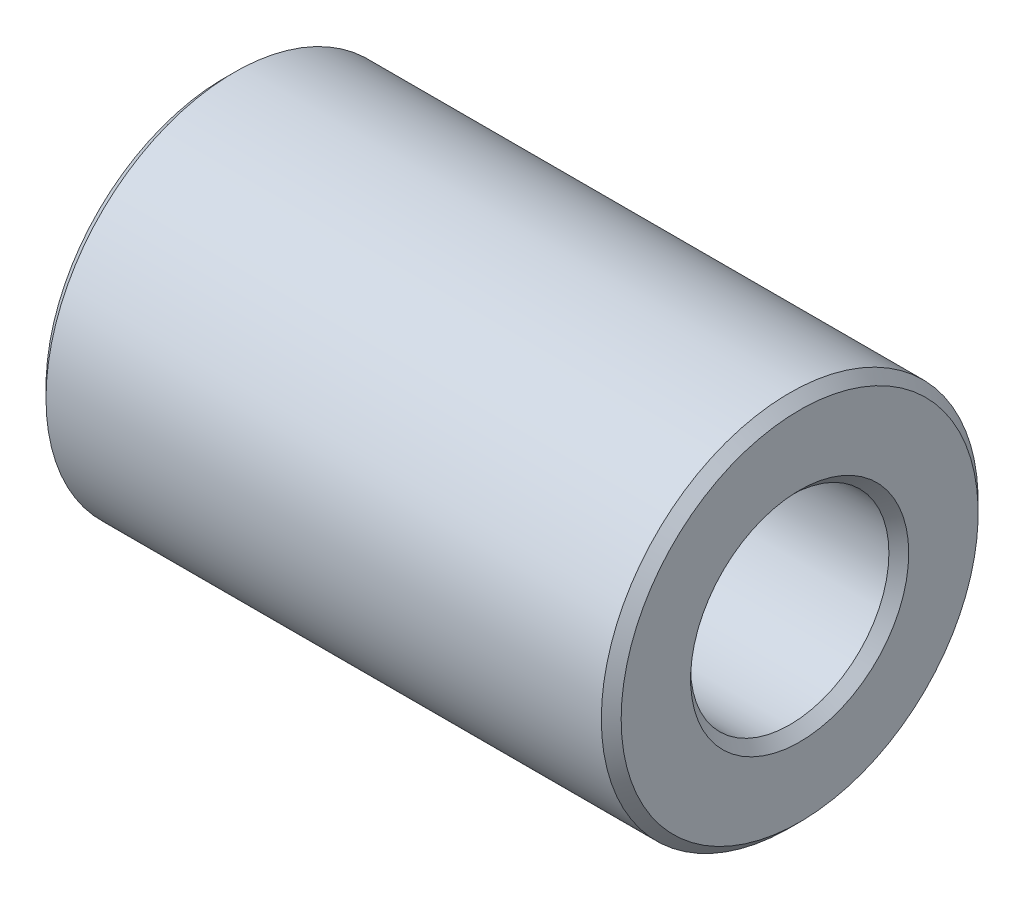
ISO-10303-21;
HEADER;
FILE_DESCRIPTION(('STEP AP214'),'2;1');
FILE_NAME('part.step','',(''),(''),'','','');
FILE_SCHEMA(('AUTOMOTIVE_DESIGN { 1 0 10303 214 1 1 1 1 }'));
ENDSEC;
DATA;
#1=APPLICATION_CONTEXT('core data for automotive mechanical design processes');
#2=APPLICATION_PROTOCOL_DEFINITION('international standard','automotive_design',2000,#1);
#3=PRODUCT_CONTEXT('',#1,'mechanical');
#4=PRODUCT('Part','Part','',(#3));
#5=PRODUCT_RELATED_PRODUCT_CATEGORY('part','',(#4));
#6=PRODUCT_DEFINITION_FORMATION('','',#4);
#7=PRODUCT_DEFINITION_CONTEXT('part definition',#1,'design');
#8=PRODUCT_DEFINITION('design','',#6,#7);
#9=PRODUCT_DEFINITION_SHAPE('','',#8);
#10=(LENGTH_UNIT() NAMED_UNIT(*) SI_UNIT(.MILLI.,.METRE.));
#11=(NAMED_UNIT(*) PLANE_ANGLE_UNIT() SI_UNIT($,.RADIAN.));
#12=(NAMED_UNIT(*) SI_UNIT($,.STERADIAN.) SOLID_ANGLE_UNIT());
#13=UNCERTAINTY_MEASURE_WITH_UNIT(LENGTH_MEASURE(1.E-05),#10,'distance_accuracy_value','');
#14=(GEOMETRIC_REPRESENTATION_CONTEXT(3) GLOBAL_UNCERTAINTY_ASSIGNED_CONTEXT((#13)) GLOBAL_UNIT_ASSIGNED_CONTEXT((#10,
#11,#12)) REPRESENTATION_CONTEXT('',''));
#15=CARTESIAN_POINT('',(0.,0.,0.));
#16=DIRECTION('',(0.,0.,1.));
#17=DIRECTION('',(1.,0.,0.));
#18=AXIS2_PLACEMENT_3D('',#15,#16,#17);
#19=CARTESIAN_POINT('',(29.,0.,0.));
#20=DIRECTION('',(-1.,0.,0.));
#21=DIRECTION('',(0.,0.,1.));
#22=AXIS2_PLACEMENT_3D('',#19,#20,#21);
#23=CYLINDRICAL_SURFACE('',#22,5.);
#24=CARTESIAN_POINT('',(0.499999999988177,0.,0.));
#25=DIRECTION('',(-1.,0.,0.));
#26=DIRECTION('',(0.,0.,1.));
#27=AXIS2_PLACEMENT_3D('',#24,#25,#26);
#28=CIRCLE('',#27,5.0000000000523);
#29=CARTESIAN_POINT('',(0.499999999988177,0.,5.0000000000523));
#30=VERTEX_POINT('',#29);
#31=EDGE_CURVE('E30',#30,#30,#28,.T.);
#32=ORIENTED_EDGE('',*,*,#31,.T.);
#33=EDGE_LOOP('',(#32));
#34=FACE_BOUND('',#33,.T.);
#35=CARTESIAN_POINT('',(28.5000000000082,0.,0.));
#36=DIRECTION('',(1.,0.,0.));
#37=DIRECTION('',(0.,0.,-1.));
#38=AXIS2_PLACEMENT_3D('',#35,#36,#37);
#39=CIRCLE('',#38,4.99999999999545);
#40=CARTESIAN_POINT('',(28.5000000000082,0.,-4.99999999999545));
#41=VERTEX_POINT('',#40);
#42=EDGE_CURVE('E33',#41,#41,#39,.T.);
#43=ORIENTED_EDGE('',*,*,#42,.T.);
#44=EDGE_LOOP('',(#43));
#45=FACE_BOUND('',#44,.T.);
#46=ADVANCED_FACE('F15',(#34,#45),#23,.F.);
#47=CARTESIAN_POINT('',(29.00000000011,0.,0.));
#48=DIRECTION('',(1.,0.,0.));
#49=DIRECTION('',(0.,0.,-1.));
#50=AXIS2_PLACEMENT_3D('',#47,#48,#49);
#51=CONICAL_SURFACE('',#50,5.50000000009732,0.785398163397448);
#52=ORIENTED_EDGE('',*,*,#42,.F.);
#53=EDGE_LOOP('',(#52));
#54=FACE_BOUND('',#53,.T.);
#55=CARTESIAN_POINT('',(29.0000000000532,0.,0.));
#56=DIRECTION('',(1.,0.,0.));
#57=DIRECTION('',(0.,0.,-1.));
#58=AXIS2_PLACEMENT_3D('',#55,#56,#57);
#59=CIRCLE('',#58,5.50000000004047);
#60=CARTESIAN_POINT('',(29.0000000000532,0.,-5.50000000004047));
#61=VERTEX_POINT('',#60);
#62=EDGE_CURVE('E18',#61,#61,#59,.F.);
#63=ORIENTED_EDGE('',*,*,#62,.F.);
#64=EDGE_LOOP('',(#63));
#65=FACE_BOUND('',#64,.T.);
#66=ADVANCED_FACE('F49',(#54,#65),#51,.F.);
#67=CARTESIAN_POINT('',(1.13686837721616E-10,0.,0.));
#68=DIRECTION('',(-1.,0.,0.));
#69=DIRECTION('',(0.,0.,1.));
#70=AXIS2_PLACEMENT_3D('',#67,#68,#69);
#71=CONICAL_SURFACE('',#70,5.49999999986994,0.785398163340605);
#72=CARTESIAN_POINT('',(0.,0.,0.));
#73=DIRECTION('',(-1.,0.,0.));
#74=DIRECTION('',(0.,0.,1.));
#75=AXIS2_PLACEMENT_3D('',#72,#73,#74);
#76=CIRCLE('',#75,5.49999999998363);
#77=CARTESIAN_POINT('',(0.,0.,5.49999999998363));
#78=VERTEX_POINT('',#77);
#79=EDGE_CURVE('E40',#78,#78,#76,.T.);
#80=ORIENTED_EDGE('',*,*,#79,.T.);
#81=EDGE_LOOP('',(#80));
#82=FACE_BOUND('',#81,.T.);
#83=ORIENTED_EDGE('',*,*,#31,.F.);
#84=EDGE_LOOP('',(#83));
#85=FACE_BOUND('',#84,.T.);
#86=ADVANCED_FACE('F51',(#82,#85),#71,.F.);
#87=CARTESIAN_POINT('',(29.,0.,0.));
#88=DIRECTION('',(1.,0.,0.));
#89=DIRECTION('',(0.,0.,-1.));
#90=AXIS2_PLACEMENT_3D('',#87,#88,#89);
#91=PLANE('',#90);
#92=CARTESIAN_POINT('',(29.,0.,0.));
#93=DIRECTION('',(-1.,0.,0.));
#94=DIRECTION('',(0.,0.,1.));
#95=AXIS2_PLACEMENT_3D('',#92,#93,#94);
#96=CIRCLE('',#95,9.00000000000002);
#97=CARTESIAN_POINT('',(29.,0.,9.00000000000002));
#98=VERTEX_POINT('',#97);
#99=EDGE_CURVE('E38',#98,#98,#96,.T.);
#100=ORIENTED_EDGE('',*,*,#99,.F.);
#101=EDGE_LOOP('',(#100));
#102=FACE_BOUND('',#101,.T.);
#103=ORIENTED_EDGE('',*,*,#62,.T.);
#104=EDGE_LOOP('',(#103));
#105=FACE_BOUND('',#104,.T.);
#106=ADVANCED_FACE('F47',(#102,#105),#91,.T.);
#107=CARTESIAN_POINT('',(0.,0.,0.));
#108=DIRECTION('',(1.,0.,0.));
#109=DIRECTION('',(0.,0.,-1.));
#110=AXIS2_PLACEMENT_3D('',#107,#108,#109);
#111=PLANE('',#110);
#112=CARTESIAN_POINT('',(0.,0.,0.));
#113=DIRECTION('',(1.,0.,0.));
#114=DIRECTION('',(0.,0.,-1.));
#115=AXIS2_PLACEMENT_3D('',#112,#113,#114);
#116=CIRCLE('',#115,8.99999999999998);
#117=CARTESIAN_POINT('',(0.,0.,-8.99999999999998));
#118=VERTEX_POINT('',#117);
#119=EDGE_CURVE('E27',#118,#118,#116,.T.);
#120=ORIENTED_EDGE('',*,*,#119,.F.);
#121=EDGE_LOOP('',(#120));
#122=FACE_BOUND('',#121,.T.);
#123=ORIENTED_EDGE('',*,*,#79,.F.);
#124=EDGE_LOOP('',(#123));
#125=FACE_BOUND('',#124,.T.);
#126=ADVANCED_FACE('F75',(#122,#125),#111,.F.);
#127=CARTESIAN_POINT('',(28.5,0.,0.));
#128=DIRECTION('',(-1.,0.,0.));
#129=DIRECTION('',(0.,0.,1.));
#130=AXIS2_PLACEMENT_3D('',#127,#128,#129);
#131=CONICAL_SURFACE('',#130,9.5,0.785398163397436);
#132=CARTESIAN_POINT('',(28.5,0.,0.));
#133=DIRECTION('',(-1.,0.,0.));
#134=DIRECTION('',(0.,0.,1.));
#135=AXIS2_PLACEMENT_3D('',#132,#133,#134);
#136=CIRCLE('',#135,9.5);
#137=CARTESIAN_POINT('',(28.5,0.,9.5));
#138=VERTEX_POINT('',#137);
#139=EDGE_CURVE('E22',#138,#138,#136,.T.);
#140=ORIENTED_EDGE('',*,*,#139,.F.);
#141=EDGE_LOOP('',(#140));
#142=FACE_BOUND('',#141,.T.);
#143=ORIENTED_EDGE('',*,*,#99,.T.);
#144=EDGE_LOOP('',(#143));
#145=FACE_BOUND('',#144,.T.);
#146=ADVANCED_FACE('F68',(#142,#145),#131,.T.);
#147=CARTESIAN_POINT('',(0.500000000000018,0.,0.));
#148=DIRECTION('',(1.,0.,0.));
#149=DIRECTION('',(0.,0.,-1.));
#150=AXIS2_PLACEMENT_3D('',#147,#148,#149);
#151=CONICAL_SURFACE('',#150,9.5,0.78539816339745);
#152=CARTESIAN_POINT('',(0.500000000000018,0.,0.));
#153=DIRECTION('',(-1.,0.,0.));
#154=DIRECTION('',(0.,0.,1.));
#155=AXIS2_PLACEMENT_3D('',#152,#153,#154);
#156=CIRCLE('',#155,9.5);
#157=CARTESIAN_POINT('',(0.500000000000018,0.,9.5));
#158=VERTEX_POINT('',#157);
#159=EDGE_CURVE('E10',#158,#158,#156,.F.);
#160=ORIENTED_EDGE('',*,*,#159,.F.);
#161=EDGE_LOOP('',(#160));
#162=FACE_BOUND('',#161,.T.);
#163=ORIENTED_EDGE('',*,*,#119,.T.);
#164=EDGE_LOOP('',(#163));
#165=FACE_BOUND('',#164,.T.);
#166=ADVANCED_FACE('F63',(#162,#165),#151,.T.);
#167=CARTESIAN_POINT('',(29.,0.,0.));
#168=DIRECTION('',(-1.,0.,0.));
#169=DIRECTION('',(0.,0.,1.));
#170=AXIS2_PLACEMENT_3D('',#167,#168,#169);
#171=CYLINDRICAL_SURFACE('',#170,9.5);
#172=ORIENTED_EDGE('',*,*,#159,.T.);
#173=EDGE_LOOP('',(#172));
#174=FACE_BOUND('',#173,.T.);
#175=ORIENTED_EDGE('',*,*,#139,.T.);
#176=EDGE_LOOP('',(#175));
#177=FACE_BOUND('',#176,.T.);
#178=ADVANCED_FACE('F61',(#174,#177),#171,.T.);
#179=CLOSED_SHELL('',(#46,#66,#86,#106,#126,#146,#166,#178));
#180=MANIFOLD_SOLID_BREP('B1',#179);
#181=ADVANCED_BREP_SHAPE_REPRESENTATION('',(#18,#180),#14);
#182=SHAPE_DEFINITION_REPRESENTATION(#9,#181);
ENDSEC;
END-ISO-10303-21;
